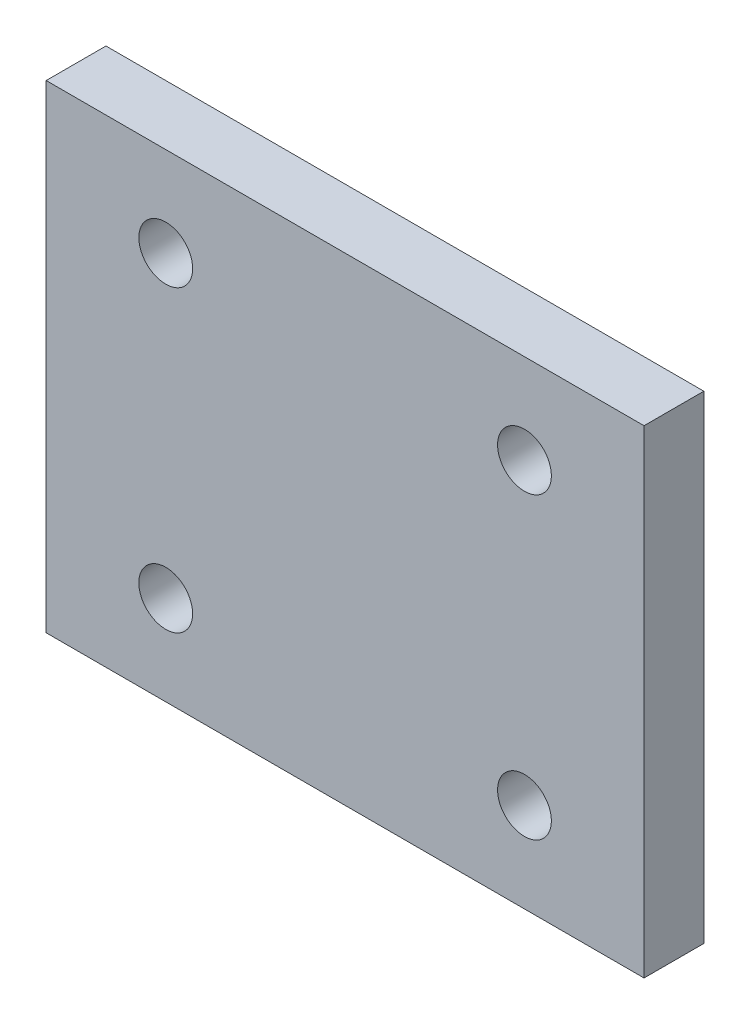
ISO-10303-21;
HEADER;
FILE_DESCRIPTION(('STEP AP214'),'2;1');
FILE_NAME('part.step','',(''),(''),'','','');
FILE_SCHEMA(('AUTOMOTIVE_DESIGN { 1 0 10303 214 1 1 1 1 }'));
ENDSEC;
DATA;
#1=APPLICATION_CONTEXT('core data for automotive mechanical design processes');
#2=APPLICATION_PROTOCOL_DEFINITION('international standard','automotive_design',2000,#1);
#3=PRODUCT_CONTEXT('',#1,'mechanical');
#4=PRODUCT('Part','Part','',(#3));
#5=PRODUCT_RELATED_PRODUCT_CATEGORY('part','',(#4));
#6=PRODUCT_DEFINITION_FORMATION('','',#4);
#7=PRODUCT_DEFINITION_CONTEXT('part definition',#1,'design');
#8=PRODUCT_DEFINITION('design','',#6,#7);
#9=PRODUCT_DEFINITION_SHAPE('','',#8);
#10=(LENGTH_UNIT() NAMED_UNIT(*) SI_UNIT(.MILLI.,.METRE.));
#11=(NAMED_UNIT(*) PLANE_ANGLE_UNIT() SI_UNIT($,.RADIAN.));
#12=(NAMED_UNIT(*) SI_UNIT($,.STERADIAN.) SOLID_ANGLE_UNIT());
#13=UNCERTAINTY_MEASURE_WITH_UNIT(LENGTH_MEASURE(1.E-05),#10,'distance_accuracy_value','');
#14=(GEOMETRIC_REPRESENTATION_CONTEXT(3) GLOBAL_UNCERTAINTY_ASSIGNED_CONTEXT((#13)) GLOBAL_UNIT_ASSIGNED_CONTEXT((#10,
#11,#12)) REPRESENTATION_CONTEXT('',''));
#15=CARTESIAN_POINT('',(0.,0.,0.));
#16=DIRECTION('',(0.,0.,1.));
#17=DIRECTION('',(1.,0.,0.));
#18=AXIS2_PLACEMENT_3D('',#15,#16,#17);
#19=CARTESIAN_POINT('',(0.,0.,20.));
#20=DIRECTION('',(0.,0.,1.));
#21=DIRECTION('',(1.,0.,0.));
#22=AXIS2_PLACEMENT_3D('',#19,#20,#21);
#23=PLANE('',#22);
#24=CARTESIAN_POINT('',(60.,50.,20.));
#25=DIRECTION('',(0.,0.,1.));
#26=DIRECTION('',(1.,0.,0.));
#27=AXIS2_PLACEMENT_3D('',#24,#25,#26);
#28=CIRCLE('',#27,9.);
#29=CARTESIAN_POINT('',(69.,50.,20.));
#30=VERTEX_POINT('',#29);
#31=EDGE_CURVE('E26',#30,#30,#28,.T.);
#32=ORIENTED_EDGE('',*,*,#31,.F.);
#33=EDGE_LOOP('',(#32));
#34=FACE_BOUND('',#33,.T.);
#35=CARTESIAN_POINT('',(60.,-50.,20.));
#36=DIRECTION('',(0.,0.,1.));
#37=DIRECTION('',(1.,0.,0.));
#38=AXIS2_PLACEMENT_3D('',#35,#36,#37);
#39=CIRCLE('',#38,9.);
#40=CARTESIAN_POINT('',(69.,-50.,20.));
#41=VERTEX_POINT('',#40);
#42=EDGE_CURVE('E82',#41,#41,#39,.T.);
#43=ORIENTED_EDGE('',*,*,#42,.F.);
#44=EDGE_LOOP('',(#43));
#45=FACE_BOUND('',#44,.T.);
#46=CARTESIAN_POINT('',(-60.,50.,20.));
#47=DIRECTION('',(0.,0.,1.));
#48=DIRECTION('',(1.,0.,0.));
#49=AXIS2_PLACEMENT_3D('',#46,#47,#48);
#50=CIRCLE('',#49,9.);
#51=CARTESIAN_POINT('',(-51.,50.,20.));
#52=VERTEX_POINT('',#51);
#53=EDGE_CURVE('E270',#52,#52,#50,.T.);
#54=ORIENTED_EDGE('',*,*,#53,.F.);
#55=EDGE_LOOP('',(#54));
#56=FACE_BOUND('',#55,.T.);
#57=CARTESIAN_POINT('',(-60.,-50.,20.));
#58=DIRECTION('',(0.,0.,1.));
#59=DIRECTION('',(1.,0.,0.));
#60=AXIS2_PLACEMENT_3D('',#57,#58,#59);
#61=CIRCLE('',#60,9.);
#62=CARTESIAN_POINT('',(-51.,-50.,20.));
#63=VERTEX_POINT('',#62);
#64=EDGE_CURVE('E262',#63,#63,#61,.T.);
#65=ORIENTED_EDGE('',*,*,#64,.F.);
#66=EDGE_LOOP('',(#65));
#67=FACE_BOUND('',#66,.T.);
#68=DIRECTION('',(1.,0.,0.));
#69=VECTOR('',#68,1.);
#70=CARTESIAN_POINT('',(-100.,-80.,20.));
#71=LINE('',#70,#69);
#72=CARTESIAN_POINT('',(-100.,-80.,20.));
#73=VERTEX_POINT('',#72);
#74=CARTESIAN_POINT('',(100.,-80.,20.));
#75=VERTEX_POINT('',#74);
#76=EDGE_CURVE('E217',#73,#75,#71,.T.);
#77=ORIENTED_EDGE('',*,*,#76,.T.);
#78=DIRECTION('',(0.,1.,0.));
#79=VECTOR('',#78,1.);
#80=CARTESIAN_POINT('',(100.,-80.,20.));
#81=LINE('',#80,#79);
#82=CARTESIAN_POINT('',(100.,80.,20.));
#83=VERTEX_POINT('',#82);
#84=EDGE_CURVE('E250',#75,#83,#81,.T.);
#85=ORIENTED_EDGE('',*,*,#84,.T.);
#86=DIRECTION('',(-1.,0.,0.));
#87=VECTOR('',#86,1.);
#88=CARTESIAN_POINT('',(100.,80.,20.));
#89=LINE('',#88,#87);
#90=CARTESIAN_POINT('',(-100.,80.,20.));
#91=VERTEX_POINT('',#90);
#92=EDGE_CURVE('E219',#83,#91,#89,.T.);
#93=ORIENTED_EDGE('',*,*,#92,.T.);
#94=DIRECTION('',(0.,-1.,0.));
#95=VECTOR('',#94,1.);
#96=CARTESIAN_POINT('',(-100.,80.,20.));
#97=LINE('',#96,#95);
#98=EDGE_CURVE('E213',#91,#73,#97,.T.);
#99=ORIENTED_EDGE('',*,*,#98,.T.);
#100=EDGE_LOOP('',(#77,#85,#93,#99));
#101=FACE_BOUND('',#100,.T.);
#102=ADVANCED_FACE('F16',(#34,#45,#56,#67,#101),#23,.T.);
#103=CARTESIAN_POINT('',(0.,0.,0.));
#104=DIRECTION('',(0.,0.,1.));
#105=DIRECTION('',(1.,0.,0.));
#106=AXIS2_PLACEMENT_3D('',#103,#104,#105);
#107=PLANE('',#106);
#108=CARTESIAN_POINT('',(60.,50.,0.));
#109=DIRECTION('',(0.,0.,1.));
#110=DIRECTION('',(1.,0.,0.));
#111=AXIS2_PLACEMENT_3D('',#108,#109,#110);
#112=CIRCLE('',#111,9.);
#113=CARTESIAN_POINT('',(69.,50.,0.));
#114=VERTEX_POINT('',#113);
#115=EDGE_CURVE('E10',#114,#114,#112,.T.);
#116=ORIENTED_EDGE('',*,*,#115,.T.);
#117=EDGE_LOOP('',(#116));
#118=FACE_BOUND('',#117,.T.);
#119=CARTESIAN_POINT('',(60.,-50.,0.));
#120=DIRECTION('',(0.,0.,1.));
#121=DIRECTION('',(1.,0.,0.));
#122=AXIS2_PLACEMENT_3D('',#119,#120,#121);
#123=CIRCLE('',#122,9.);
#124=CARTESIAN_POINT('',(69.,-50.,0.));
#125=VERTEX_POINT('',#124);
#126=EDGE_CURVE('E88',#125,#125,#123,.T.);
#127=ORIENTED_EDGE('',*,*,#126,.T.);
#128=EDGE_LOOP('',(#127));
#129=FACE_BOUND('',#128,.T.);
#130=CARTESIAN_POINT('',(-60.,50.,0.));
#131=DIRECTION('',(0.,0.,1.));
#132=DIRECTION('',(1.,0.,0.));
#133=AXIS2_PLACEMENT_3D('',#130,#131,#132);
#134=CIRCLE('',#133,9.);
#135=CARTESIAN_POINT('',(-51.,50.,0.));
#136=VERTEX_POINT('',#135);
#137=EDGE_CURVE('E95',#136,#136,#134,.T.);
#138=ORIENTED_EDGE('',*,*,#137,.T.);
#139=EDGE_LOOP('',(#138));
#140=FACE_BOUND('',#139,.T.);
#141=CARTESIAN_POINT('',(-60.,-50.,0.));
#142=DIRECTION('',(0.,0.,1.));
#143=DIRECTION('',(1.,0.,0.));
#144=AXIS2_PLACEMENT_3D('',#141,#142,#143);
#145=CIRCLE('',#144,9.);
#146=CARTESIAN_POINT('',(-51.,-50.,0.));
#147=VERTEX_POINT('',#146);
#148=EDGE_CURVE('E265',#147,#147,#145,.T.);
#149=ORIENTED_EDGE('',*,*,#148,.T.);
#150=EDGE_LOOP('',(#149));
#151=FACE_BOUND('',#150,.T.);
#152=DIRECTION('',(0.,-1.,0.));
#153=VECTOR('',#152,1.);
#154=CARTESIAN_POINT('',(-100.,80.,0.));
#155=LINE('',#154,#153);
#156=CARTESIAN_POINT('',(-100.,80.,0.));
#157=VERTEX_POINT('',#156);
#158=CARTESIAN_POINT('',(-100.,-80.,0.));
#159=VERTEX_POINT('',#158);
#160=EDGE_CURVE('E224',#157,#159,#155,.T.);
#161=ORIENTED_EDGE('',*,*,#160,.F.);
#162=DIRECTION('',(-1.,0.,0.));
#163=VECTOR('',#162,1.);
#164=CARTESIAN_POINT('',(100.,80.,0.));
#165=LINE('',#164,#163);
#166=CARTESIAN_POINT('',(100.,80.,0.));
#167=VERTEX_POINT('',#166);
#168=EDGE_CURVE('E252',#167,#157,#165,.T.);
#169=ORIENTED_EDGE('',*,*,#168,.F.);
#170=DIRECTION('',(0.,1.,0.));
#171=VECTOR('',#170,1.);
#172=CARTESIAN_POINT('',(100.,-80.,0.));
#173=LINE('',#172,#171);
#174=CARTESIAN_POINT('',(100.,-80.,0.));
#175=VERTEX_POINT('',#174);
#176=EDGE_CURVE('E231',#175,#167,#173,.T.);
#177=ORIENTED_EDGE('',*,*,#176,.F.);
#178=DIRECTION('',(1.,0.,0.));
#179=VECTOR('',#178,1.);
#180=CARTESIAN_POINT('',(-100.,-80.,0.));
#181=LINE('',#180,#179);
#182=EDGE_CURVE('E239',#159,#175,#181,.T.);
#183=ORIENTED_EDGE('',*,*,#182,.F.);
#184=EDGE_LOOP('',(#161,#169,#177,#183));
#185=FACE_BOUND('',#184,.T.);
#186=ADVANCED_FACE('F18',(#118,#129,#140,#151,#185),#107,.F.);
#187=CARTESIAN_POINT('',(60.,50.,0.));
#188=DIRECTION('',(0.,0.,-1.));
#189=DIRECTION('',(1.,0.,0.));
#190=AXIS2_PLACEMENT_3D('',#187,#188,#189);
#191=CYLINDRICAL_SURFACE('',#190,9.);
#192=DIRECTION('',(0.,0.,1.));
#193=VECTOR('',#192,1.);
#194=CARTESIAN_POINT('',(69.,50.,0.));
#195=LINE('',#194,#193);
#196=EDGE_CURVE('E93',#114,#30,#195,.T.);
#197=ORIENTED_EDGE('',*,*,#196,.T.);
#198=ORIENTED_EDGE('',*,*,#31,.T.);
#199=ORIENTED_EDGE('',*,*,#196,.F.);
#200=ORIENTED_EDGE('',*,*,#115,.F.);
#201=EDGE_LOOP('',(#197,#198,#199,#200));
#202=FACE_BOUND('',#201,.T.);
#203=ADVANCED_FACE('F107',(#202),#191,.F.);
#204=CARTESIAN_POINT('',(60.,-50.,0.));
#205=DIRECTION('',(0.,0.,-1.));
#206=DIRECTION('',(1.,0.,0.));
#207=AXIS2_PLACEMENT_3D('',#204,#205,#206);
#208=CYLINDRICAL_SURFACE('',#207,9.);
#209=DIRECTION('',(0.,0.,1.));
#210=VECTOR('',#209,1.);
#211=CARTESIAN_POINT('',(69.,-50.,0.));
#212=LINE('',#211,#210);
#213=EDGE_CURVE('E85',#125,#41,#212,.T.);
#214=ORIENTED_EDGE('',*,*,#213,.T.);
#215=ORIENTED_EDGE('',*,*,#42,.T.);
#216=ORIENTED_EDGE('',*,*,#213,.F.);
#217=ORIENTED_EDGE('',*,*,#126,.F.);
#218=EDGE_LOOP('',(#214,#215,#216,#217));
#219=FACE_BOUND('',#218,.T.);
#220=ADVANCED_FACE('F83',(#219),#208,.F.);
#221=CARTESIAN_POINT('',(-60.,50.,0.));
#222=DIRECTION('',(0.,0.,-1.));
#223=DIRECTION('',(1.,0.,0.));
#224=AXIS2_PLACEMENT_3D('',#221,#222,#223);
#225=CYLINDRICAL_SURFACE('',#224,9.);
#226=DIRECTION('',(0.,0.,1.));
#227=VECTOR('',#226,1.);
#228=CARTESIAN_POINT('',(-51.,50.,0.));
#229=LINE('',#228,#227);
#230=EDGE_CURVE('E266',#136,#52,#229,.T.);
#231=ORIENTED_EDGE('',*,*,#230,.T.);
#232=ORIENTED_EDGE('',*,*,#53,.T.);
#233=ORIENTED_EDGE('',*,*,#230,.F.);
#234=ORIENTED_EDGE('',*,*,#137,.F.);
#235=EDGE_LOOP('',(#231,#232,#233,#234));
#236=FACE_BOUND('',#235,.T.);
#237=ADVANCED_FACE('F167',(#236),#225,.F.);
#238=CARTESIAN_POINT('',(-60.,-50.,0.));
#239=DIRECTION('',(0.,0.,-1.));
#240=DIRECTION('',(1.,0.,0.));
#241=AXIS2_PLACEMENT_3D('',#238,#239,#240);
#242=CYLINDRICAL_SURFACE('',#241,9.);
#243=DIRECTION('',(0.,0.,1.));
#244=VECTOR('',#243,1.);
#245=CARTESIAN_POINT('',(-51.,-50.,0.));
#246=LINE('',#245,#244);
#247=EDGE_CURVE('E223',#147,#63,#246,.T.);
#248=ORIENTED_EDGE('',*,*,#247,.T.);
#249=ORIENTED_EDGE('',*,*,#64,.T.);
#250=ORIENTED_EDGE('',*,*,#247,.F.);
#251=ORIENTED_EDGE('',*,*,#148,.F.);
#252=EDGE_LOOP('',(#248,#249,#250,#251));
#253=FACE_BOUND('',#252,.T.);
#254=ADVANCED_FACE('F158',(#253),#242,.F.);
#255=CARTESIAN_POINT('',(-100.,80.,0.));
#256=DIRECTION('',(1.,0.,0.));
#257=DIRECTION('',(0.,1.,0.));
#258=AXIS2_PLACEMENT_3D('',#255,#256,#257);
#259=PLANE('',#258);
#260=ORIENTED_EDGE('',*,*,#160,.T.);
#261=DIRECTION('',(0.,0.,1.));
#262=VECTOR('',#261,1.);
#263=CARTESIAN_POINT('',(-100.,-80.,0.));
#264=LINE('',#263,#262);
#265=EDGE_CURVE('E227',#159,#73,#264,.T.);
#266=ORIENTED_EDGE('',*,*,#265,.T.);
#267=ORIENTED_EDGE('',*,*,#98,.F.);
#268=DIRECTION('',(0.,0.,1.));
#269=VECTOR('',#268,1.);
#270=CARTESIAN_POINT('',(-100.,80.,0.));
#271=LINE('',#270,#269);
#272=EDGE_CURVE('E257',#157,#91,#271,.T.);
#273=ORIENTED_EDGE('',*,*,#272,.F.);
#274=EDGE_LOOP('',(#260,#266,#267,#273));
#275=FACE_BOUND('',#274,.T.);
#276=ADVANCED_FACE('F142',(#275),#259,.F.);
#277=CARTESIAN_POINT('',(100.,80.,0.));
#278=DIRECTION('',(0.,-1.,0.));
#279=DIRECTION('',(0.,0.,-1.));
#280=AXIS2_PLACEMENT_3D('',#277,#278,#279);
#281=PLANE('',#280);
#282=ORIENTED_EDGE('',*,*,#168,.T.);
#283=ORIENTED_EDGE('',*,*,#272,.T.);
#284=ORIENTED_EDGE('',*,*,#92,.F.);
#285=DIRECTION('',(0.,0.,1.));
#286=VECTOR('',#285,1.);
#287=CARTESIAN_POINT('',(100.,80.,0.));
#288=LINE('',#287,#286);
#289=EDGE_CURVE('E246',#167,#83,#288,.T.);
#290=ORIENTED_EDGE('',*,*,#289,.F.);
#291=EDGE_LOOP('',(#282,#283,#284,#290));
#292=FACE_BOUND('',#291,.T.);
#293=ADVANCED_FACE('F137',(#292),#281,.F.);
#294=CARTESIAN_POINT('',(100.,-80.,0.));
#295=DIRECTION('',(-1.,0.,0.));
#296=DIRECTION('',(0.,0.,1.));
#297=AXIS2_PLACEMENT_3D('',#294,#295,#296);
#298=PLANE('',#297);
#299=ORIENTED_EDGE('',*,*,#176,.T.);
#300=ORIENTED_EDGE('',*,*,#289,.T.);
#301=ORIENTED_EDGE('',*,*,#84,.F.);
#302=DIRECTION('',(0.,0.,1.));
#303=VECTOR('',#302,1.);
#304=CARTESIAN_POINT('',(100.,-80.,0.));
#305=LINE('',#304,#303);
#306=EDGE_CURVE('E234',#175,#75,#305,.T.);
#307=ORIENTED_EDGE('',*,*,#306,.F.);
#308=EDGE_LOOP('',(#299,#300,#301,#307));
#309=FACE_BOUND('',#308,.T.);
#310=ADVANCED_FACE('F123',(#309),#298,.F.);
#311=CARTESIAN_POINT('',(-100.,-80.,0.));
#312=DIRECTION('',(0.,1.,0.));
#313=DIRECTION('',(1.,0.,0.));
#314=AXIS2_PLACEMENT_3D('',#311,#312,#313);
#315=PLANE('',#314);
#316=ORIENTED_EDGE('',*,*,#182,.T.);
#317=ORIENTED_EDGE('',*,*,#306,.T.);
#318=ORIENTED_EDGE('',*,*,#76,.F.);
#319=ORIENTED_EDGE('',*,*,#265,.F.);
#320=EDGE_LOOP('',(#316,#317,#318,#319));
#321=FACE_BOUND('',#320,.T.);
#322=ADVANCED_FACE('F118',(#321),#315,.F.);
#323=CLOSED_SHELL('',(#102,#186,#203,#220,#237,#254,#276,#293,#310,#322));
#324=MANIFOLD_SOLID_BREP('B1',#323);
#325=ADVANCED_BREP_SHAPE_REPRESENTATION('',(#18,#324),#14);
#326=SHAPE_DEFINITION_REPRESENTATION(#9,#325);
ENDSEC;
END-ISO-10303-21;
